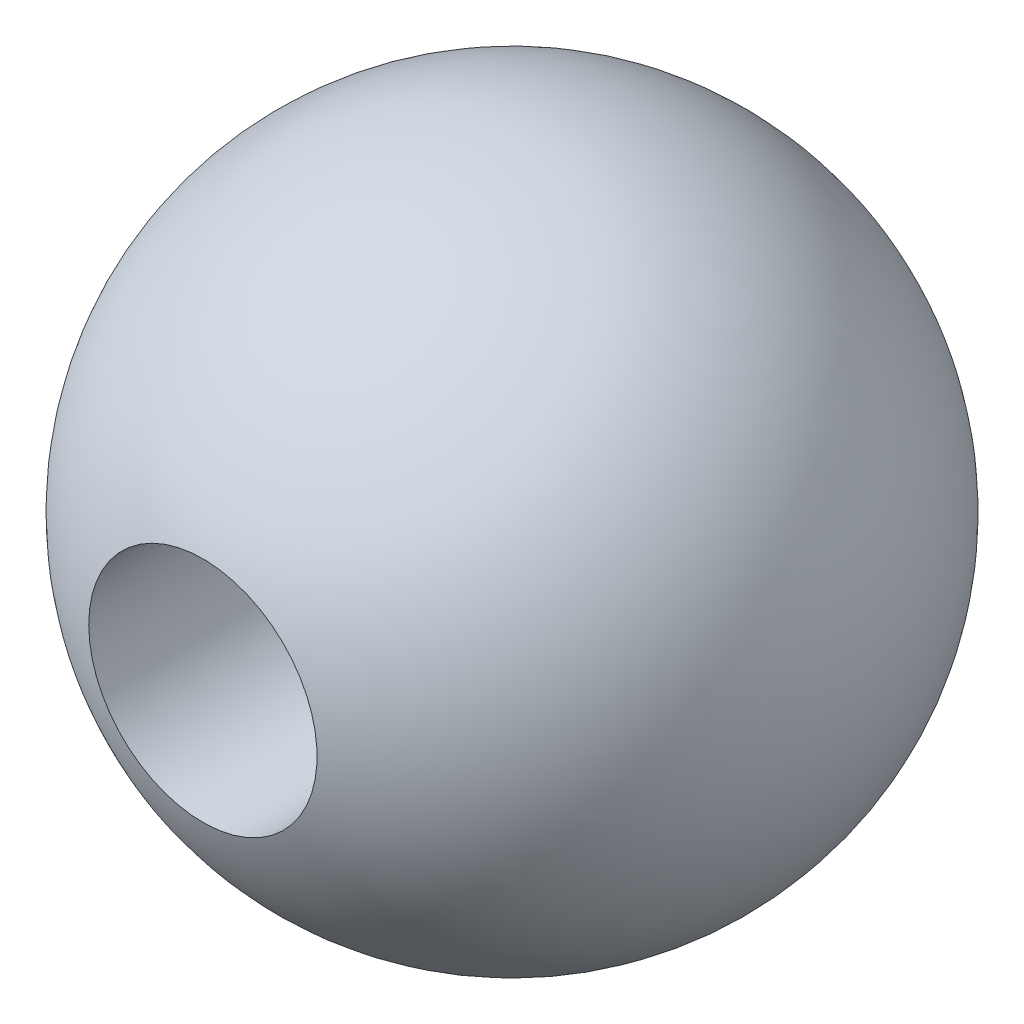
from build123d import *

# Parameters (mm, degrees)
CUT_EXTRUDE_2_DEPTH      = 5
CUT_EXTRUDE_2_DEPTH_BACK = 5
SKETCH_2_R               = 0.75


with BuildPart() as part:
    # Sketch 1 → Revolve 2 (revolve)
    with BuildSketch(Plane.XY):
        with BuildLine():
            Line((0, 2.165), (0, -2.165))
            ThreePointArc((0, -2.165), (-2.165, 0), (0, 2.165))
        make_face()
    revolve(axis=Axis((0, 2.165, 0), (0, -1, 0)))

    # Sketch 2 → Cut-Extrude 2 (cut, two sides: drawn at the far end of the back side and taken through both)
    with BuildSketch(Plane.XY.offset(-CUT_EXTRUDE_2_DEPTH_BACK)):
        with Locations(Location((0, 0, 0), (0, 0, 180))):
            Circle(SKETCH_2_R)
    extrude(amount=CUT_EXTRUDE_2_DEPTH + CUT_EXTRUDE_2_DEPTH_BACK, mode=Mode.SUBTRACT)


solid = part.part
